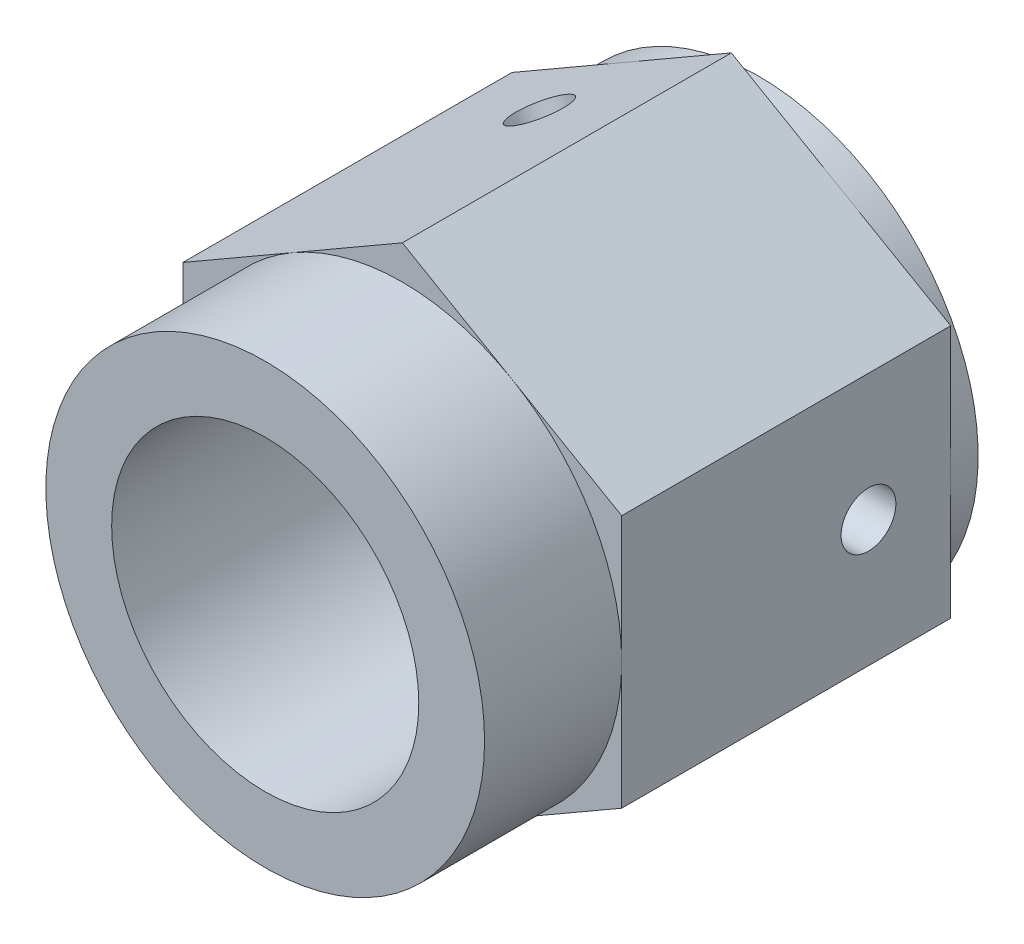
ISO-10303-21;
HEADER;
FILE_DESCRIPTION(('STEP AP214'),'2;1');
FILE_NAME('part.step','',(''),(''),'','','');
FILE_SCHEMA(('AUTOMOTIVE_DESIGN { 1 0 10303 214 1 1 1 1 }'));
ENDSEC;
DATA;
#1=APPLICATION_CONTEXT('core data for automotive mechanical design processes');
#2=APPLICATION_PROTOCOL_DEFINITION('international standard','automotive_design',2000,#1);
#3=PRODUCT_CONTEXT('',#1,'mechanical');
#4=PRODUCT('Part','Part','',(#3));
#5=PRODUCT_RELATED_PRODUCT_CATEGORY('part','',(#4));
#6=PRODUCT_DEFINITION_FORMATION('','',#4);
#7=PRODUCT_DEFINITION_CONTEXT('part definition',#1,'design');
#8=PRODUCT_DEFINITION('design','',#6,#7);
#9=PRODUCT_DEFINITION_SHAPE('','',#8);
#10=(LENGTH_UNIT() NAMED_UNIT(*) SI_UNIT(.MILLI.,.METRE.));
#11=(NAMED_UNIT(*) PLANE_ANGLE_UNIT() SI_UNIT($,.RADIAN.));
#12=(NAMED_UNIT(*) SI_UNIT($,.STERADIAN.) SOLID_ANGLE_UNIT());
#13=UNCERTAINTY_MEASURE_WITH_UNIT(LENGTH_MEASURE(1.E-05),#10,'distance_accuracy_value','');
#14=(GEOMETRIC_REPRESENTATION_CONTEXT(3) GLOBAL_UNCERTAINTY_ASSIGNED_CONTEXT((#13)) GLOBAL_UNIT_ASSIGNED_CONTEXT((#10,
#11,#12)) REPRESENTATION_CONTEXT('',''));
#15=CARTESIAN_POINT('',(0.,0.,0.));
#16=DIRECTION('',(0.,0.,1.));
#17=DIRECTION('',(1.,0.,0.));
#18=AXIS2_PLACEMENT_3D('',#15,#16,#17);
#19=CARTESIAN_POINT('',(0.,0.,0.));
#20=DIRECTION('',(0.,0.,1.));
#21=DIRECTION('',(1.,0.,0.));
#22=AXIS2_PLACEMENT_3D('',#19,#20,#21);
#23=PLANE('',#22);
#24=CARTESIAN_POINT('',(0.,0.,0.));
#25=DIRECTION('',(0.,0.,-1.));
#26=DIRECTION('',(-1.,0.,0.));
#27=AXIS2_PLACEMENT_3D('',#24,#25,#26);
#28=CIRCLE('',#27,40.);
#29=CARTESIAN_POINT('',(-40.,0.,0.));
#30=VERTEX_POINT('',#29);
#31=CARTESIAN_POINT('',(-20.,34.6410161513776,0.));
#32=VERTEX_POINT('',#31);
#33=EDGE_CURVE('E52',#30,#32,#28,.T.);
#34=ORIENTED_EDGE('',*,*,#33,.F.);
#35=DIRECTION('',(0.,-1.,0.));
#36=VECTOR('',#35,1.);
#37=CARTESIAN_POINT('',(-40.,23.094010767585,0.));
#38=LINE('',#37,#36);
#39=CARTESIAN_POINT('',(-40.,23.094010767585,0.));
#40=VERTEX_POINT('',#39);
#41=EDGE_CURVE('E135',#40,#30,#38,.T.);
#42=ORIENTED_EDGE('',*,*,#41,.F.);
#43=DIRECTION('',(-0.866025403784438,-0.5,0.));
#44=VECTOR('',#43,1.);
#45=CARTESIAN_POINT('',(0.,46.1880215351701,0.));
#46=LINE('',#45,#44);
#47=EDGE_CURVE('E152',#32,#40,#46,.T.);
#48=ORIENTED_EDGE('',*,*,#47,.F.);
#49=EDGE_LOOP('',(#34,#42,#48));
#50=FACE_BOUND('',#49,.T.);
#51=ADVANCED_FACE('F37',(#50),#23,.F.);
#52=CARTESIAN_POINT('',(20.,34.6410161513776,0.));
#53=VERTEX_POINT('',#52);
#54=EDGE_CURVE('E11',#32,#53,#28,.T.);
#55=ORIENTED_EDGE('',*,*,#54,.F.);
#56=CARTESIAN_POINT('',(0.,46.1880215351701,0.));
#57=VERTEX_POINT('',#56);
#58=EDGE_CURVE('E150',#57,#32,#46,.T.);
#59=ORIENTED_EDGE('',*,*,#58,.F.);
#60=DIRECTION('',(-0.866025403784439,0.5,0.));
#61=VECTOR('',#60,1.);
#62=CARTESIAN_POINT('',(40.,23.0940107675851,0.));
#63=LINE('',#62,#61);
#64=EDGE_CURVE('E172',#53,#57,#63,.T.);
#65=ORIENTED_EDGE('',*,*,#64,.F.);
#66=EDGE_LOOP('',(#55,#59,#65));
#67=FACE_BOUND('',#66,.T.);
#68=ADVANCED_FACE('F260',(#67),#23,.F.);
#69=CARTESIAN_POINT('',(40.,0.,0.));
#70=VERTEX_POINT('',#69);
#71=EDGE_CURVE('E50',#53,#70,#28,.T.);
#72=ORIENTED_EDGE('',*,*,#71,.F.);
#73=CARTESIAN_POINT('',(40.,23.0940107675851,0.));
#74=VERTEX_POINT('',#73);
#75=EDGE_CURVE('E200',#74,#53,#63,.T.);
#76=ORIENTED_EDGE('',*,*,#75,.F.);
#77=DIRECTION('',(0.,1.,0.));
#78=VECTOR('',#77,1.);
#79=CARTESIAN_POINT('',(40.,-23.094010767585,0.));
#80=LINE('',#79,#78);
#81=EDGE_CURVE('E209',#70,#74,#80,.T.);
#82=ORIENTED_EDGE('',*,*,#81,.F.);
#83=EDGE_LOOP('',(#72,#76,#82));
#84=FACE_BOUND('',#83,.T.);
#85=ADVANCED_FACE('F266',(#84),#23,.F.);
#86=CARTESIAN_POINT('',(20.,-34.6410161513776,0.));
#87=VERTEX_POINT('',#86);
#88=EDGE_CURVE('E162',#70,#87,#28,.T.);
#89=ORIENTED_EDGE('',*,*,#88,.F.);
#90=CARTESIAN_POINT('',(40.,-23.094010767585,0.));
#91=VERTEX_POINT('',#90);
#92=EDGE_CURVE('E210',#91,#70,#80,.T.);
#93=ORIENTED_EDGE('',*,*,#92,.F.);
#94=DIRECTION('',(0.866025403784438,0.5,0.));
#95=VECTOR('',#94,1.);
#96=CARTESIAN_POINT('',(0.,-46.1880215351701,0.));
#97=LINE('',#96,#95);
#98=EDGE_CURVE('E205',#87,#91,#97,.T.);
#99=ORIENTED_EDGE('',*,*,#98,.F.);
#100=EDGE_LOOP('',(#89,#93,#99));
#101=FACE_BOUND('',#100,.T.);
#102=ADVANCED_FACE('F287',(#101),#23,.F.);
#103=CARTESIAN_POINT('',(-20.,-34.6410161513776,0.));
#104=VERTEX_POINT('',#103);
#105=EDGE_CURVE('E160',#87,#104,#28,.T.);
#106=ORIENTED_EDGE('',*,*,#105,.F.);
#107=CARTESIAN_POINT('',(0.,-46.1880215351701,0.));
#108=VERTEX_POINT('',#107);
#109=EDGE_CURVE('E206',#108,#87,#97,.T.);
#110=ORIENTED_EDGE('',*,*,#109,.F.);
#111=DIRECTION('',(0.866025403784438,-0.5,0.));
#112=VECTOR('',#111,1.);
#113=CARTESIAN_POINT('',(-40.,-23.094010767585,0.));
#114=LINE('',#113,#112);
#115=EDGE_CURVE('E145',#104,#108,#114,.T.);
#116=ORIENTED_EDGE('',*,*,#115,.F.);
#117=EDGE_LOOP('',(#106,#110,#116));
#118=FACE_BOUND('',#117,.T.);
#119=ADVANCED_FACE('F272',(#118),#23,.F.);
#120=CARTESIAN_POINT('',(0.,0.,60.));
#121=DIRECTION('',(0.,0.,1.));
#122=DIRECTION('',(1.,0.,0.));
#123=AXIS2_PLACEMENT_3D('',#120,#121,#122);
#124=PLANE('',#123);
#125=CARTESIAN_POINT('',(0.,0.,60.));
#126=DIRECTION('',(0.,0.,1.));
#127=DIRECTION('',(1.,0.,0.));
#128=AXIS2_PLACEMENT_3D('',#125,#126,#127);
#129=CIRCLE('',#128,40.);
#130=CARTESIAN_POINT('',(40.,0.,60.));
#131=VERTEX_POINT('',#130);
#132=CARTESIAN_POINT('',(20.,34.6410161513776,60.));
#133=VERTEX_POINT('',#132);
#134=EDGE_CURVE('E166',#131,#133,#129,.T.);
#135=ORIENTED_EDGE('',*,*,#134,.F.);
#136=DIRECTION('',(0.,1.,0.));
#137=VECTOR('',#136,1.);
#138=CARTESIAN_POINT('',(40.,-23.094010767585,60.));
#139=LINE('',#138,#137);
#140=CARTESIAN_POINT('',(40.,23.0940107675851,60.));
#141=VERTEX_POINT('',#140);
#142=EDGE_CURVE('E196',#131,#141,#139,.T.);
#143=ORIENTED_EDGE('',*,*,#142,.T.);
#144=DIRECTION('',(-0.866025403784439,0.5,0.));
#145=VECTOR('',#144,1.);
#146=CARTESIAN_POINT('',(40.,23.0940107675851,60.));
#147=LINE('',#146,#145);
#148=EDGE_CURVE('E176',#141,#133,#147,.T.);
#149=ORIENTED_EDGE('',*,*,#148,.T.);
#150=EDGE_LOOP('',(#135,#143,#149));
#151=FACE_BOUND('',#150,.T.);
#152=ADVANCED_FACE('F284',(#151),#124,.T.);
#153=CARTESIAN_POINT('',(-20.,34.6410161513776,60.));
#154=VERTEX_POINT('',#153);
#155=EDGE_CURVE('E161',#133,#154,#129,.T.);
#156=ORIENTED_EDGE('',*,*,#155,.F.);
#157=CARTESIAN_POINT('',(0.,46.1880215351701,60.));
#158=VERTEX_POINT('',#157);
#159=EDGE_CURVE('E180',#133,#158,#147,.T.);
#160=ORIENTED_EDGE('',*,*,#159,.T.);
#161=DIRECTION('',(-0.866025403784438,-0.5,0.));
#162=VECTOR('',#161,1.);
#163=CARTESIAN_POINT('',(0.,46.1880215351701,60.));
#164=LINE('',#163,#162);
#165=EDGE_CURVE('E181',#158,#154,#164,.T.);
#166=ORIENTED_EDGE('',*,*,#165,.T.);
#167=EDGE_LOOP('',(#156,#160,#166));
#168=FACE_BOUND('',#167,.T.);
#169=ADVANCED_FACE('F294',(#168),#124,.T.);
#170=CARTESIAN_POINT('',(-40.,0.,60.));
#171=VERTEX_POINT('',#170);
#172=EDGE_CURVE('E164',#154,#171,#129,.T.);
#173=ORIENTED_EDGE('',*,*,#172,.F.);
#174=CARTESIAN_POINT('',(-40.,23.094010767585,60.));
#175=VERTEX_POINT('',#174);
#176=EDGE_CURVE('E179',#154,#175,#164,.T.);
#177=ORIENTED_EDGE('',*,*,#176,.T.);
#178=DIRECTION('',(0.,-1.,0.));
#179=VECTOR('',#178,1.);
#180=CARTESIAN_POINT('',(-40.,23.094010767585,60.));
#181=LINE('',#180,#179);
#182=EDGE_CURVE('E185',#175,#171,#181,.T.);
#183=ORIENTED_EDGE('',*,*,#182,.T.);
#184=EDGE_LOOP('',(#173,#177,#183));
#185=FACE_BOUND('',#184,.T.);
#186=ADVANCED_FACE('F330',(#185),#124,.T.);
#187=CARTESIAN_POINT('',(-20.,-34.6410161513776,60.));
#188=VERTEX_POINT('',#187);
#189=EDGE_CURVE('E327',#171,#188,#129,.T.);
#190=ORIENTED_EDGE('',*,*,#189,.F.);
#191=CARTESIAN_POINT('',(-40.,-23.094010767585,60.));
#192=VERTEX_POINT('',#191);
#193=EDGE_CURVE('E184',#171,#192,#181,.T.);
#194=ORIENTED_EDGE('',*,*,#193,.T.);
#195=DIRECTION('',(0.866025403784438,-0.5,0.));
#196=VECTOR('',#195,1.);
#197=CARTESIAN_POINT('',(-40.,-23.094010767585,60.));
#198=LINE('',#197,#196);
#199=EDGE_CURVE('E189',#192,#188,#198,.T.);
#200=ORIENTED_EDGE('',*,*,#199,.T.);
#201=EDGE_LOOP('',(#190,#194,#200));
#202=FACE_BOUND('',#201,.T.);
#203=ADVANCED_FACE('F339',(#202),#124,.T.);
#204=CARTESIAN_POINT('',(20.,-34.6410161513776,60.));
#205=VERTEX_POINT('',#204);
#206=EDGE_CURVE('E321',#188,#205,#129,.T.);
#207=ORIENTED_EDGE('',*,*,#206,.F.);
#208=CARTESIAN_POINT('',(0.,-46.1880215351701,60.));
#209=VERTEX_POINT('',#208);
#210=EDGE_CURVE('E188',#188,#209,#198,.T.);
#211=ORIENTED_EDGE('',*,*,#210,.T.);
#212=DIRECTION('',(0.866025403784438,0.5,0.));
#213=VECTOR('',#212,1.);
#214=CARTESIAN_POINT('',(0.,-46.1880215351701,60.));
#215=LINE('',#214,#213);
#216=EDGE_CURVE('E193',#209,#205,#215,.T.);
#217=ORIENTED_EDGE('',*,*,#216,.T.);
#218=EDGE_LOOP('',(#207,#211,#217));
#219=FACE_BOUND('',#218,.T.);
#220=ADVANCED_FACE('F285',(#219),#124,.T.);
#221=CARTESIAN_POINT('',(40.,23.0940107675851,60.));
#222=DIRECTION('',(-0.5,-0.866025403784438,0.));
#223=DIRECTION('',(0.866025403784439,-0.5,0.));
#224=AXIS2_PLACEMENT_3D('',#221,#222,#223);
#225=PLANE('',#224);
#226=ORIENTED_EDGE('',*,*,#75,.T.);
#227=ORIENTED_EDGE('',*,*,#64,.T.);
#228=DIRECTION('',(0.,0.,-1.));
#229=VECTOR('',#228,1.);
#230=CARTESIAN_POINT('',(0.,46.1880215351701,60.));
#231=LINE('',#230,#229);
#232=EDGE_CURVE('E224',#158,#57,#231,.T.);
#233=ORIENTED_EDGE('',*,*,#232,.F.);
#234=ORIENTED_EDGE('',*,*,#159,.F.);
#235=ORIENTED_EDGE('',*,*,#148,.F.);
#236=DIRECTION('',(0.,0.,-1.));
#237=VECTOR('',#236,1.);
#238=CARTESIAN_POINT('',(40.,23.0940107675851,60.));
#239=LINE('',#238,#237);
#240=EDGE_CURVE('E199',#141,#74,#239,.T.);
#241=ORIENTED_EDGE('',*,*,#240,.T.);
#242=EDGE_LOOP('',(#226,#227,#233,#234,#235,#241));
#243=FACE_BOUND('',#242,.T.);
#244=ADVANCED_FACE('F39',(#243),#225,.F.);
#245=CARTESIAN_POINT('',(0.,46.1880215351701,60.));
#246=DIRECTION('',(0.5,-0.866025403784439,0.));
#247=DIRECTION('',(0.866025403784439,0.5,0.));
#248=AXIS2_PLACEMENT_3D('',#245,#246,#247);
#249=PLANE('',#248);
#250=CARTESIAN_POINT('',(-20.,34.6410161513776,15.));
#251=DIRECTION('',(-0.5,0.866025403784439,0.));
#252=DIRECTION('',(-0.866025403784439,-0.5,0.));
#253=AXIS2_PLACEMENT_3D('',#250,#251,#252);
#254=CIRCLE('',#253,5.);
#255=CARTESIAN_POINT('',(-24.3301270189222,32.1410161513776,15.));
#256=VERTEX_POINT('',#255);
#257=EDGE_CURVE('E233',#256,#256,#254,.T.);
#258=ORIENTED_EDGE('',*,*,#257,.F.);
#259=EDGE_LOOP('',(#258));
#260=FACE_BOUND('',#259,.T.);
#261=ORIENTED_EDGE('',*,*,#58,.T.);
#262=ORIENTED_EDGE('',*,*,#47,.T.);
#263=DIRECTION('',(0.,0.,-1.));
#264=VECTOR('',#263,1.);
#265=CARTESIAN_POINT('',(-40.,23.094010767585,60.));
#266=LINE('',#265,#264);
#267=EDGE_CURVE('E142',#175,#40,#266,.T.);
#268=ORIENTED_EDGE('',*,*,#267,.F.);
#269=ORIENTED_EDGE('',*,*,#176,.F.);
#270=ORIENTED_EDGE('',*,*,#165,.F.);
#271=ORIENTED_EDGE('',*,*,#232,.T.);
#272=EDGE_LOOP('',(#261,#262,#268,#269,#270,#271));
#273=FACE_BOUND('',#272,.T.);
#274=ADVANCED_FACE('F333',(#260,#273),#249,.F.);
#275=CARTESIAN_POINT('',(-40.,23.094010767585,60.));
#276=DIRECTION('',(1.,0.,0.));
#277=DIRECTION('',(0.,0.,-1.));
#278=AXIS2_PLACEMENT_3D('',#275,#276,#277);
#279=PLANE('',#278);
#280=ORIENTED_EDGE('',*,*,#41,.T.);
#281=CARTESIAN_POINT('',(-40.,-23.094010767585,0.));
#282=VERTEX_POINT('',#281);
#283=EDGE_CURVE('E138',#30,#282,#38,.T.);
#284=ORIENTED_EDGE('',*,*,#283,.T.);
#285=DIRECTION('',(0.,0.,-1.));
#286=VECTOR('',#285,1.);
#287=CARTESIAN_POINT('',(-40.,-23.094010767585,60.));
#288=LINE('',#287,#286);
#289=EDGE_CURVE('E221',#192,#282,#288,.T.);
#290=ORIENTED_EDGE('',*,*,#289,.F.);
#291=ORIENTED_EDGE('',*,*,#193,.F.);
#292=ORIENTED_EDGE('',*,*,#182,.F.);
#293=ORIENTED_EDGE('',*,*,#267,.T.);
#294=EDGE_LOOP('',(#280,#284,#290,#291,#292,#293));
#295=FACE_BOUND('',#294,.T.);
#296=ADVANCED_FACE('F136',(#295),#279,.F.);
#297=CARTESIAN_POINT('',(-40.,-23.094010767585,60.));
#298=DIRECTION('',(0.5,0.866025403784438,0.));
#299=DIRECTION('',(-0.866025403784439,0.5,0.));
#300=AXIS2_PLACEMENT_3D('',#297,#298,#299);
#301=PLANE('',#300);
#302=CARTESIAN_POINT('',(-20.,-34.6410161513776,15.));
#303=DIRECTION('',(-0.5,-0.866025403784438,0.));
#304=DIRECTION('',(0.866025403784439,-0.5,0.));
#305=AXIS2_PLACEMENT_3D('',#302,#303,#304);
#306=CIRCLE('',#305,5.);
#307=CARTESIAN_POINT('',(-15.6698729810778,-37.1410161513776,15.));
#308=VERTEX_POINT('',#307);
#309=EDGE_CURVE('E370',#308,#308,#306,.T.);
#310=ORIENTED_EDGE('',*,*,#309,.F.);
#311=EDGE_LOOP('',(#310));
#312=FACE_BOUND('',#311,.T.);
#313=EDGE_CURVE('E149',#282,#104,#114,.T.);
#314=ORIENTED_EDGE('',*,*,#313,.T.);
#315=ORIENTED_EDGE('',*,*,#115,.T.);
#316=DIRECTION('',(0.,0.,-1.));
#317=VECTOR('',#316,1.);
#318=CARTESIAN_POINT('',(0.,-46.1880215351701,60.));
#319=LINE('',#318,#317);
#320=EDGE_CURVE('E218',#209,#108,#319,.T.);
#321=ORIENTED_EDGE('',*,*,#320,.F.);
#322=ORIENTED_EDGE('',*,*,#210,.F.);
#323=ORIENTED_EDGE('',*,*,#199,.F.);
#324=ORIENTED_EDGE('',*,*,#289,.T.);
#325=EDGE_LOOP('',(#314,#315,#321,#322,#323,#324));
#326=FACE_BOUND('',#325,.T.);
#327=ADVANCED_FACE('F401',(#312,#326),#301,.F.);
#328=CARTESIAN_POINT('',(0.,-46.1880215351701,60.));
#329=DIRECTION('',(-0.5,0.866025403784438,0.));
#330=DIRECTION('',(-0.866025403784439,-0.5,0.));
#331=AXIS2_PLACEMENT_3D('',#328,#329,#330);
#332=PLANE('',#331);
#333=ORIENTED_EDGE('',*,*,#109,.T.);
#334=ORIENTED_EDGE('',*,*,#98,.T.);
#335=DIRECTION('',(0.,0.,-1.));
#336=VECTOR('',#335,1.);
#337=CARTESIAN_POINT('',(40.,-23.094010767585,60.));
#338=LINE('',#337,#336);
#339=CARTESIAN_POINT('',(40.,-23.094010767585,60.));
#340=VERTEX_POINT('',#339);
#341=EDGE_CURVE('E215',#340,#91,#338,.T.);
#342=ORIENTED_EDGE('',*,*,#341,.F.);
#343=EDGE_CURVE('E192',#205,#340,#215,.T.);
#344=ORIENTED_EDGE('',*,*,#343,.F.);
#345=ORIENTED_EDGE('',*,*,#216,.F.);
#346=ORIENTED_EDGE('',*,*,#320,.T.);
#347=EDGE_LOOP('',(#333,#334,#342,#344,#345,#346));
#348=FACE_BOUND('',#347,.T.);
#349=ADVANCED_FACE('F303',(#348),#332,.F.);
#350=CARTESIAN_POINT('',(40.,-23.094010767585,60.));
#351=DIRECTION('',(-1.,0.,0.));
#352=DIRECTION('',(0.,0.,1.));
#353=AXIS2_PLACEMENT_3D('',#350,#351,#352);
#354=PLANE('',#353);
#355=CARTESIAN_POINT('',(40.,0.,15.));
#356=DIRECTION('',(1.,0.,0.));
#357=DIRECTION('',(0.,0.,-1.));
#358=AXIS2_PLACEMENT_3D('',#355,#356,#357);
#359=CIRCLE('',#358,5.);
#360=CARTESIAN_POINT('',(40.,0.,10.));
#361=VERTEX_POINT('',#360);
#362=EDGE_CURVE('E373',#361,#361,#359,.T.);
#363=ORIENTED_EDGE('',*,*,#362,.F.);
#364=EDGE_LOOP('',(#363));
#365=FACE_BOUND('',#364,.T.);
#366=ORIENTED_EDGE('',*,*,#92,.T.);
#367=ORIENTED_EDGE('',*,*,#81,.T.);
#368=ORIENTED_EDGE('',*,*,#240,.F.);
#369=ORIENTED_EDGE('',*,*,#142,.F.);
#370=EDGE_CURVE('E197',#340,#131,#139,.T.);
#371=ORIENTED_EDGE('',*,*,#370,.F.);
#372=ORIENTED_EDGE('',*,*,#341,.T.);
#373=EDGE_LOOP('',(#366,#367,#368,#369,#371,#372));
#374=FACE_BOUND('',#373,.T.);
#375=ADVANCED_FACE('F282',(#365,#374),#354,.F.);
#376=EDGE_CURVE('E175',#205,#131,#129,.T.);
#377=ORIENTED_EDGE('',*,*,#376,.F.);
#378=ORIENTED_EDGE('',*,*,#343,.T.);
#379=ORIENTED_EDGE('',*,*,#370,.T.);
#380=EDGE_LOOP('',(#377,#378,#379));
#381=FACE_BOUND('',#380,.T.);
#382=ADVANCED_FACE('F271',(#381),#124,.T.);
#383=EDGE_CURVE('E65',#104,#30,#28,.T.);
#384=ORIENTED_EDGE('',*,*,#383,.F.);
#385=ORIENTED_EDGE('',*,*,#313,.F.);
#386=ORIENTED_EDGE('',*,*,#283,.F.);
#387=EDGE_LOOP('',(#384,#385,#386));
#388=FACE_BOUND('',#387,.T.);
#389=ADVANCED_FACE('F147',(#388),#23,.F.);
#390=CARTESIAN_POINT('',(0.,0.,85.));
#391=DIRECTION('',(0.,0.,-1.));
#392=DIRECTION('',(-1.,0.,0.));
#393=AXIS2_PLACEMENT_3D('',#390,#391,#392);
#394=CYLINDRICAL_SURFACE('',#393,40.);
#395=CARTESIAN_POINT('',(0.,0.,85.));
#396=DIRECTION('',(0.,0.,1.));
#397=DIRECTION('',(1.,0.,0.));
#398=AXIS2_PLACEMENT_3D('',#395,#396,#397);
#399=CIRCLE('',#398,40.);
#400=CARTESIAN_POINT('',(40.,0.,85.));
#401=VERTEX_POINT('',#400);
#402=EDGE_CURVE('E170',#401,#401,#399,.T.);
#403=ORIENTED_EDGE('',*,*,#402,.F.);
#404=EDGE_LOOP('',(#403));
#405=FACE_BOUND('',#404,.T.);
#406=ORIENTED_EDGE('',*,*,#134,.T.);
#407=ORIENTED_EDGE('',*,*,#155,.T.);
#408=ORIENTED_EDGE('',*,*,#172,.T.);
#409=ORIENTED_EDGE('',*,*,#189,.T.);
#410=ORIENTED_EDGE('',*,*,#206,.T.);
#411=ORIENTED_EDGE('',*,*,#376,.T.);
#412=EDGE_LOOP('',(#406,#407,#408,#409,#410,#411));
#413=FACE_BOUND('',#412,.T.);
#414=ADVANCED_FACE('F270',(#405,#413),#394,.T.);
#415=CARTESIAN_POINT('',(0.,0.,85.));
#416=DIRECTION('',(0.,0.,1.));
#417=DIRECTION('',(1.,0.,0.));
#418=AXIS2_PLACEMENT_3D('',#415,#416,#417);
#419=PLANE('',#418);
#420=CARTESIAN_POINT('',(0.,0.,85.));
#421=DIRECTION('',(0.,0.,1.));
#422=DIRECTION('',(1.,0.,0.));
#423=AXIS2_PLACEMENT_3D('',#420,#421,#422);
#424=CIRCLE('',#423,28.);
#425=CARTESIAN_POINT('',(28.,0.,85.));
#426=VERTEX_POINT('',#425);
#427=EDGE_CURVE('E232',#426,#426,#424,.T.);
#428=ORIENTED_EDGE('',*,*,#427,.F.);
#429=EDGE_LOOP('',(#428));
#430=FACE_BOUND('',#429,.T.);
#431=ORIENTED_EDGE('',*,*,#402,.T.);
#432=EDGE_LOOP('',(#431));
#433=FACE_BOUND('',#432,.T.);
#434=ADVANCED_FACE('F278',(#430,#433),#419,.T.);
#435=CARTESIAN_POINT('',(0.,0.,-5.));
#436=DIRECTION('',(0.,0.,1.));
#437=DIRECTION('',(1.,0.,0.));
#438=AXIS2_PLACEMENT_3D('',#435,#436,#437);
#439=CYLINDRICAL_SURFACE('',#438,40.);
#440=CARTESIAN_POINT('',(0.,0.,-5.));
#441=DIRECTION('',(0.,0.,-1.));
#442=DIRECTION('',(-1.,0.,0.));
#443=AXIS2_PLACEMENT_3D('',#440,#441,#442);
#444=CIRCLE('',#443,40.);
#445=CARTESIAN_POINT('',(-40.,0.,-5.));
#446=VERTEX_POINT('',#445);
#447=EDGE_CURVE('E155',#446,#446,#444,.T.);
#448=ORIENTED_EDGE('',*,*,#447,.F.);
#449=EDGE_LOOP('',(#448));
#450=FACE_BOUND('',#449,.T.);
#451=ORIENTED_EDGE('',*,*,#33,.T.);
#452=ORIENTED_EDGE('',*,*,#54,.T.);
#453=ORIENTED_EDGE('',*,*,#71,.T.);
#454=ORIENTED_EDGE('',*,*,#88,.T.);
#455=ORIENTED_EDGE('',*,*,#105,.T.);
#456=ORIENTED_EDGE('',*,*,#383,.T.);
#457=EDGE_LOOP('',(#451,#452,#453,#454,#455,#456));
#458=FACE_BOUND('',#457,.T.);
#459=ADVANCED_FACE('F158',(#450,#458),#439,.T.);
#460=CARTESIAN_POINT('',(0.,0.,-5.));
#461=DIRECTION('',(0.,0.,-1.));
#462=DIRECTION('',(-1.,0.,0.));
#463=AXIS2_PLACEMENT_3D('',#460,#461,#462);
#464=PLANE('',#463);
#465=CARTESIAN_POINT('',(0.,0.,-5.));
#466=DIRECTION('',(0.,0.,-1.));
#467=DIRECTION('',(-1.,0.,0.));
#468=AXIS2_PLACEMENT_3D('',#465,#466,#467);
#469=CIRCLE('',#468,15.);
#470=CARTESIAN_POINT('',(-15.,0.,-5.));
#471=VERTEX_POINT('',#470);
#472=EDGE_CURVE('E156',#471,#471,#469,.T.);
#473=ORIENTED_EDGE('',*,*,#472,.F.);
#474=EDGE_LOOP('',(#473));
#475=FACE_BOUND('',#474,.T.);
#476=ORIENTED_EDGE('',*,*,#447,.T.);
#477=EDGE_LOOP('',(#476));
#478=FACE_BOUND('',#477,.T.);
#479=ADVANCED_FACE('F345',(#475,#478),#464,.T.);
#480=CARTESIAN_POINT('',(0.,0.,40.));
#481=DIRECTION('',(0.,0.,-1.));
#482=DIRECTION('',(-1.,0.,0.));
#483=AXIS2_PLACEMENT_3D('',#480,#481,#482);
#484=CYLINDRICAL_SURFACE('',#483,15.);
#485=CARTESIAN_POINT('',(15.,0.,10.));
#486=CARTESIAN_POINT('',(15.0000007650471,0.272816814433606,9.99999873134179));
#487=CARTESIAN_POINT('',(14.9924884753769,0.545625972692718,10.022401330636));
#488=CARTESIAN_POINT('',(14.9632605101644,1.08320880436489,10.1111455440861));
#489=CARTESIAN_POINT('',(14.941543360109,1.3479816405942,10.1774917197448));
#490=CARTESIAN_POINT('',(14.8862653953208,1.86166394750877,10.3515962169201));
#491=CARTESIAN_POINT('',(14.8527243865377,2.11059912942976,10.4592853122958));
#492=CARTESIAN_POINT('',(14.7772222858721,2.58687468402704,10.7127058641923));
#493=CARTESIAN_POINT('',(14.7352595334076,2.81421078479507,10.8584448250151));
#494=CARTESIAN_POINT('',(14.6457047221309,3.24870837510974,11.1891290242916));
#495=CARTESIAN_POINT('',(14.5979778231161,3.45501850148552,11.3751561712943));
#496=CARTESIAN_POINT('',(14.5030157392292,3.83416346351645,11.778835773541));
#497=CARTESIAN_POINT('',(14.4557806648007,4.00699092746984,11.9964951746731));
#498=CARTESIAN_POINT('',(14.3656666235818,4.31912471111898,12.4649255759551));
#499=CARTESIAN_POINT('',(14.3229519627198,4.45732429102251,12.7164686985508));
#500=CARTESIAN_POINT('',(14.2487652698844,4.68909436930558,13.2408804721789));
#501=CARTESIAN_POINT('',(14.2172898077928,4.78267848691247,13.5137425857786));
#502=CARTESIAN_POINT('',(14.1705651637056,4.91936730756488,14.0633661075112));
#503=CARTESIAN_POINT('',(14.1548047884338,4.96406724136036,14.3396860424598));
#504=CARTESIAN_POINT('',(14.1397828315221,5.00670561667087,14.896318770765));
#505=CARTESIAN_POINT('',(14.1405161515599,5.00465850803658,15.1766303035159));
#506=CARTESIAN_POINT('',(14.1579507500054,4.95509951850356,15.7196831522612));
#507=CARTESIAN_POINT('',(14.1739207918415,4.90966956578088,15.9826420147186));
#508=CARTESIAN_POINT('',(14.2188328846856,4.77803081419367,16.4969670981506));
#509=CARTESIAN_POINT('',(14.2477764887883,4.69181713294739,16.7483319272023));
#510=CARTESIAN_POINT('',(14.3158955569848,4.47969529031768,17.2370637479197));
#511=CARTESIAN_POINT('',(14.3552282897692,4.35317024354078,17.4741401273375));
#512=CARTESIAN_POINT('',(14.4396279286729,4.06444553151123,17.9243545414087));
#513=CARTESIAN_POINT('',(14.4846964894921,3.9022355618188,18.1374856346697));
#514=CARTESIAN_POINT('',(14.5783664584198,3.53674666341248,18.5454579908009));
#515=CARTESIAN_POINT('',(14.6270294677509,3.3317657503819,18.7387634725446));
#516=CARTESIAN_POINT('',(14.7203469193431,2.89169784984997,19.0886563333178));
#517=CARTESIAN_POINT('',(14.765000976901,2.65660797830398,19.2452401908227));
#518=CARTESIAN_POINT('',(14.8458553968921,2.15973806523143,19.5184815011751));
#519=CARTESIAN_POINT('',(14.8819675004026,1.89771638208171,19.6347274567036));
#520=CARTESIAN_POINT('',(14.9410283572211,1.35634541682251,19.8210158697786));
#521=CARTESIAN_POINT('',(14.9639816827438,1.07700219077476,19.8910743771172));
#522=CARTESIAN_POINT('',(14.9933813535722,0.521919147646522,19.9802783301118));
#523=CARTESIAN_POINT('',(15.0005000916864,0.246547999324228,20.0014990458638));
#524=CARTESIAN_POINT('',(14.9994451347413,-0.303875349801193,19.9983366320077));
#525=CARTESIAN_POINT('',(14.9912740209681,-0.578927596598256,19.9739612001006));
#526=CARTESIAN_POINT('',(14.9610012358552,-1.11259933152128,19.8819404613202));
#527=CARTESIAN_POINT('',(14.9393099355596,-1.37146403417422,19.8155689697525));
#528=CARTESIAN_POINT('',(14.8845923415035,-1.87427979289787,19.6430327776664));
#529=CARTESIAN_POINT('',(14.8515646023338,-2.11822894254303,19.5368630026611));
#530=CARTESIAN_POINT('',(14.7764465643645,-2.59144148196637,19.2846478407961));
#531=CARTESIAN_POINT('',(14.7341407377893,-2.82014979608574,19.1376270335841));
#532=CARTESIAN_POINT('',(14.6452626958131,-3.25032415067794,18.8090292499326));
#533=CARTESIAN_POINT('',(14.5986891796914,-3.45178183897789,18.6274417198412));
#534=CARTESIAN_POINT('',(14.5038423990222,-3.8312625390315,18.2251062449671));
#535=CARTESIAN_POINT('',(14.4555880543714,-4.00780484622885,18.0029538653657));
#536=CARTESIAN_POINT('',(14.3649986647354,-4.32128761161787,17.5311421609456));
#537=CARTESIAN_POINT('',(14.3226636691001,-4.45822773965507,17.2814826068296));
#538=CARTESIAN_POINT('',(14.2491195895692,-4.68798465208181,16.7616349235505));
#539=CARTESIAN_POINT('',(14.2178880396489,-4.78089066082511,16.4914896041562));
#540=CARTESIAN_POINT('',(14.1705416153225,-4.91947333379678,15.9381067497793));
#541=CARTESIAN_POINT('',(14.154419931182,-4.9651712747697,15.6548751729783));
#542=CARTESIAN_POINT('',(14.1398929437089,-5.00638141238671,15.0990145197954));
#543=CARTESIAN_POINT('',(14.1406200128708,-5.004351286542,14.8265882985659));
#544=CARTESIAN_POINT('',(14.1575634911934,-4.95621146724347,14.2861746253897));
#545=CARTESIAN_POINT('',(14.1737789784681,-4.91010439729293,14.0181869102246));
#546=CARTESIAN_POINT('',(14.2192262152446,-4.77685906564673,13.4993216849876));
#547=CARTESIAN_POINT('',(14.2482049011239,-4.69051673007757,13.2482158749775));
#548=CARTESIAN_POINT('',(14.3158199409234,-4.47989682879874,12.7638629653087));
#549=CARTESIAN_POINT('',(14.3544584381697,-4.35561084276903,12.53061984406));
#550=CARTESIAN_POINT('',(14.4391414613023,-4.06630346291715,12.0775816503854));
#551=CARTESIAN_POINT('',(14.4854355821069,-3.8997412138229,11.8588174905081));
#552=CARTESIAN_POINT('',(14.5791678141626,-3.53321441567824,11.451550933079));
#553=CARTESIAN_POINT('',(14.6266062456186,-3.33324042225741,11.2630571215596));
#554=CARTESIAN_POINT('',(14.7195015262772,-2.89620778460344,10.9142779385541));
#555=CARTESIAN_POINT('',(14.7648090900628,-2.65800756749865,10.755378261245));
#556=CARTESIAN_POINT('',(14.8462995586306,-2.15678678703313,10.4800478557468));
#557=CARTESIAN_POINT('',(14.8824847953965,-1.89377259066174,10.3636062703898));
#558=CARTESIAN_POINT('',(14.9402757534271,-1.36246823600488,10.1813918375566));
#559=CARTESIAN_POINT('',(14.9624606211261,-1.09493878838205,10.1135876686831));
#560=CARTESIAN_POINT('',(14.9923203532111,-0.551602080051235,10.0228985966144));
#561=CARTESIAN_POINT('',(14.9999992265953,-0.275797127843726,10.0000012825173));
#562=CARTESIAN_POINT('',(15.,0.,10.));
#563=B_SPLINE_CURVE_WITH_KNOTS('',3,(#485,#486,#487,#488,#489,#490,#491,#492,#493,#494,#495,
#496,#497,#498,#499,#500,#501,#502,#503,#504,#505,#506,#507,#508,#509,#510,#511,#512,#513,#514,
#515,#516,#517,#518,#519,#520,#521,#522,#523,#524,#525,#526,#527,#528,#529,#530,#531,#532,#533,
#534,#535,#536,#537,#538,#539,#540,#541,#542,#543,#544,#545,#546,#547,#548,#549,#550,#551,#552,
#553,#554,#555,#556,#557,#558,#559,#560,#561,#562),.UNSPECIFIED.,.T.,.F.,(4,2,2,2,2,2,2,2,2,2,2,
2,2,2,2,2,2,2,2,2,2,2,2,2,2,2,2,2,2,2,2,2,2,2,2,2,2,2,4),(0.,0.817435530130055,1.6349559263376,
2.45111336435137,3.2674318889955,4.1092342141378,4.95122166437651,5.81741924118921,
6.6833522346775,7.52009628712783,8.3565816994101,9.15484132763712,9.9531965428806,
10.764408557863,11.5758551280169,12.4296652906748,13.2835572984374,14.1459202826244,
15.0079834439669,15.832679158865,16.6572356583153,17.4579078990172,18.2586822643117,
19.0805199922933,19.9026090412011,20.7620511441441,21.6215004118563,22.479200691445,
23.3365142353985,24.1497833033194,24.9630039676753,25.7607793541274,26.5587319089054,
27.3915033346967,28.2245105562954,29.0899830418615,29.9552340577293,30.7818279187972,
31.6081933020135),.UNSPECIFIED.);
#564=CARTESIAN_POINT('',(15.,0.,10.));
#565=VERTEX_POINT('',#564);
#566=EDGE_CURVE('E41',#565,#565,#563,.T.);
#567=ORIENTED_EDGE('',*,*,#566,.T.);
#568=EDGE_LOOP('',(#567));
#569=FACE_BOUND('',#568,.T.);
#570=CARTESIAN_POINT('',(-2.74094079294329,-14.7474487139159,15.));
#571=CARTESIAN_POINT('',(-2.7409392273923,-14.7474485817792,15.2723408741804));
#572=CARTESIAN_POINT('',(-2.7642521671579,-14.7431730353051,15.544673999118));
#573=CARTESIAN_POINT('',(-2.85621974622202,-14.7256290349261,16.0812721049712));
#574=CARTESIAN_POINT('',(-2.92488185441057,-14.7123590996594,16.3455357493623));
#575=CARTESIAN_POINT('',(-3.10387971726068,-14.6756322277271,16.8581344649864));
#576=CARTESIAN_POINT('',(-3.21413379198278,-14.6521952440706,17.1064996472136));
#577=CARTESIAN_POINT('',(-3.47146220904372,-14.5933652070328,17.5818002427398));
#578=CARTESIAN_POINT('',(-3.61854467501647,-14.5579695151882,17.8087309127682));
#579=CARTESIAN_POINT('',(-3.94975384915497,-14.4716858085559,18.2435998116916));
#580=CARTESIAN_POINT('',(-4.13501077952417,-14.42029217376,18.4505771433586));
#581=CARTESIAN_POINT('',(-4.53246809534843,-14.3003416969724,18.8310340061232));
#582=CARTESIAN_POINT('',(-4.74467279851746,-14.231782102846,19.0045081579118));
#583=CARTESIAN_POINT('',(-5.19485467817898,-14.073797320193,19.317394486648));
#584=CARTESIAN_POINT('',(-5.43335983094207,-13.9838743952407,19.4557998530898));
#585=CARTESIAN_POINT('',(-5.92316770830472,-13.7835396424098,19.6879579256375));
#586=CARTESIAN_POINT('',(-6.1744669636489,-13.6731333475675,19.7817226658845));
#587=CARTESIAN_POINT('',(-6.67228822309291,-13.4370303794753,19.918679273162));
#588=CARTESIAN_POINT('',(-6.91867222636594,-13.3119993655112,19.963517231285));
#589=CARTESIAN_POINT('',(-7.40713565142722,-13.0465140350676,20.0065814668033));
#590=CARTESIAN_POINT('',(-7.64921616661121,-12.9060637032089,20.0048197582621));
#591=CARTESIAN_POINT('',(-8.11230738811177,-12.6198934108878,19.9557787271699));
#592=CARTESIAN_POINT('',(-8.33377208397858,-12.4745961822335,19.9102873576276));
#593=CARTESIAN_POINT('',(-8.76030230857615,-12.1788542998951,19.7780350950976));
#594=CARTESIAN_POINT('',(-8.96536672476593,-12.0284092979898,19.6912714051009));
#595=CARTESIAN_POINT('',(-9.35744889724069,-11.7260521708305,19.4778934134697));
#596=CARTESIAN_POINT('',(-9.54419402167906,-11.5741467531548,19.3507703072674));
#597=CARTESIAN_POINT('',(-9.8935865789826,-11.2769513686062,19.0607014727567));
#598=CARTESIAN_POINT('',(-10.0562272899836,-11.1316632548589,18.8977457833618));
#599=CARTESIAN_POINT('',(-10.3624817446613,-10.8473362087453,18.5316280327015));
#600=CARTESIAN_POINT('',(-10.5048391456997,-10.7089135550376,18.3269342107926));
#601=CARTESIAN_POINT('',(-10.7594278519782,-10.4531031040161,17.8877563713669));
#602=CARTESIAN_POINT('',(-10.8716545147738,-10.3357185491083,17.6532677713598));
#603=CARTESIAN_POINT('',(-11.0661436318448,-10.1272484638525,17.1567318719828));
#604=CARTESIAN_POINT('',(-11.1479560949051,-10.0365617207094,16.8943393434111));
#605=CARTESIAN_POINT('',(-11.2782028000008,-9.88998833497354,16.3521430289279));
#606=CARTESIAN_POINT('',(-11.326651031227,-9.83408710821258,16.0723465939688));
#607=CARTESIAN_POINT('',(-11.3879957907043,-9.7629744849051,15.5168082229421));
#608=CARTESIAN_POINT('',(-11.4023976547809,-9.74604111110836,15.2414528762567));
#609=CARTESIAN_POINT('',(-11.3998353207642,-9.74903958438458,14.6911192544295));
#610=CARTESIAN_POINT('',(-11.3828768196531,-9.76896473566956,14.4161409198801));
#611=CARTESIAN_POINT('',(-11.3190215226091,-9.84286385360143,13.8842151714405));
#612=CARTESIAN_POINT('',(-11.2731731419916,-9.89564470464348,13.6269728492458));
#613=CARTESIAN_POINT('',(-11.1531628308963,-10.0307060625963,13.1272819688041));
#614=CARTESIAN_POINT('',(-11.0789958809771,-10.1129917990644,12.8848360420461));
#615=CARTESIAN_POINT('',(-10.9003947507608,-10.3052941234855,12.413097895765));
#616=CARTESIAN_POINT('',(-10.7950751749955,-10.4161074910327,12.184466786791));
#617=CARTESIAN_POINT('',(-10.5562368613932,-10.6580822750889,11.7542697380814));
#618=CARTESIAN_POINT('',(-10.4227098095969,-10.7892496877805,11.5527118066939));
#619=CARTESIAN_POINT('',(-10.121669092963,-11.0723280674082,11.1723600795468));
#620=CARTESIAN_POINT('',(-9.95282935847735,-11.2249334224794,10.9951280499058));
#621=CARTESIAN_POINT('',(-9.58779783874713,-11.5382800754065,10.6804192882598));
#622=CARTESIAN_POINT('',(-9.39160702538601,-11.6990210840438,10.5429411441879));
#623=CARTESIAN_POINT('',(-8.97669175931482,-12.0202875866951,10.3128994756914));
#624=CARTESIAN_POINT('',(-8.75812567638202,-12.1808074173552,10.2200436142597));
#625=CARTESIAN_POINT('',(-8.30251436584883,-12.4957920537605,10.0813612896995));
#626=CARTESIAN_POINT('',(-8.06547584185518,-12.6502590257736,10.0355178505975));
#627=CARTESIAN_POINT('',(-7.59117962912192,-12.9401554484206,9.99368961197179));
#628=CARTESIAN_POINT('',(-7.35445585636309,-13.0761384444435,9.99546273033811));
#629=CARTESIAN_POINT('',(-6.87744560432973,-13.3331966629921,10.043286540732));
#630=CARTESIAN_POINT('',(-6.63715941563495,-13.4542730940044,10.0893336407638));
#631=CARTESIAN_POINT('',(-6.16430238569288,-13.6773061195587,10.2229111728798));
#632=CARTESIAN_POINT('',(-5.9316696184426,-13.7795358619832,10.3097710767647));
#633=CARTESIAN_POINT('',(-5.47712585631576,-13.966443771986,10.5218876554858));
#634=CARTESIAN_POINT('',(-5.25521680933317,-14.0511187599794,10.6471512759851));
#635=CARTESIAN_POINT('',(-4.82077704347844,-14.2061709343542,10.93784756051));
#636=CARTESIAN_POINT('',(-4.60889580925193,-14.2759042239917,11.1045934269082));
#637=CARTESIAN_POINT('',(-4.2104186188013,-14.3984692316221,11.471286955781));
#638=CARTESIAN_POINT('',(-4.02383076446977,-14.4512955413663,11.6712452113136));
#639=CARTESIAN_POINT('',(-3.67565609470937,-14.543841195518,12.1080467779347));
#640=CARTESIAN_POINT('',(-3.51533386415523,-14.5829665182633,12.3460275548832));
#641=CARTESIAN_POINT('',(-3.23570886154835,-14.6475555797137,12.8466721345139));
#642=CARTESIAN_POINT('',(-3.11639537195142,-14.6730228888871,13.1093294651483));
#643=CARTESIAN_POINT('',(-2.92896715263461,-14.7115582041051,13.6398091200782));
#644=CARTESIAN_POINT('',(-2.85878193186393,-14.7251346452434,13.9068613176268));
#645=CARTESIAN_POINT('',(-2.76477754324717,-14.7430783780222,14.4492802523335));
#646=CARTESIAN_POINT('',(-2.74094237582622,-14.7474488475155,14.7246440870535));
#647=CARTESIAN_POINT('',(-2.74094079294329,-14.7474487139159,15.));
#648=B_SPLINE_CURVE_WITH_KNOTS('',3,(#570,#571,#572,#573,#574,#575,#576,#577,#578,#579,#580,
#581,#582,#583,#584,#585,#586,#587,#588,#589,#590,#591,#592,#593,#594,#595,#596,#597,#598,#599,
#600,#601,#602,#603,#604,#605,#606,#607,#608,#609,#610,#611,#612,#613,#614,#615,#616,#617,#618,
#619,#620,#621,#622,#623,#624,#625,#626,#627,#628,#629,#630,#631,#632,#633,#634,#635,#636,#637,
#638,#639,#640,#641,#642,#643,#644,#645,#646,#647),.UNSPECIFIED.,.T.,.F.,(4,2,2,2,2,2,2,2,2,2,2,
2,2,2,2,2,2,2,2,2,2,2,2,2,2,2,2,2,2,2,2,2,2,2,2,2,2,2,4),(0.,0.81600292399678,1.63214027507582,
2.44668313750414,3.26140583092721,4.10506687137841,4.9488632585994,5.81467530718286,
6.68025381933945,7.51571593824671,8.35096266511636,9.15345024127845,9.95599220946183,
10.7690827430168,11.5823995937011,12.4340087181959,13.2857489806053,14.1496319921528,
15.0131525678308,15.837714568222,16.6621267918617,17.4582197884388,18.2544539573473,
19.0759428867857,19.8976742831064,20.7589404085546,21.6201759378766,22.4756895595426,
23.3308941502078,24.1459042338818,24.9608482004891,25.7628478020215,26.5649925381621,
27.3967759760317,28.2288252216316,29.0934451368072,29.9578389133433,30.7831606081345,
31.6081973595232),.UNSPECIFIED.);
#649=CARTESIAN_POINT('',(-2.74094079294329,-14.7474487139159,15.));
#650=VERTEX_POINT('',#649);
#651=EDGE_CURVE('E234',#650,#650,#648,.T.);
#652=ORIENTED_EDGE('',*,*,#651,.T.);
#653=EDGE_LOOP('',(#652));
#654=FACE_BOUND('',#653,.T.);
#655=CARTESIAN_POINT('',(-11.4011948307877,9.74744871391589,15.));
#656=CARTESIAN_POINT('',(-11.4011954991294,9.7474472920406,15.2723408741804));
#657=CARTESIAN_POINT('',(-11.385836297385,9.76549911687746,15.544673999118));
#658=CARTESIAN_POINT('',(-11.3246589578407,9.83637337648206,16.0812721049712));
#659=CARTESIAN_POINT('',(-11.2788358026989,9.88920153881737,16.3455357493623));
#660=CARTESIAN_POINT('',(-11.1575304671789,10.0258547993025,16.8581344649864));
#661=CARTESIAN_POINT('',(-11.0821064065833,10.1096191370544,17.1064996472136));
#662=CARTESIAN_POINT('',(-10.9024938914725,10.3030570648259,17.5818002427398));
#663=CARTESIAN_POINT('',(-10.7982990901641,10.4127363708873,17.8087309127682));
#664=CARTESIAN_POINT('',(-10.5579706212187,10.6564300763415,18.2435998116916));
#665=CARTESIAN_POINT('',(-10.420833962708,10.7911704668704,18.4505771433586));
#666=CARTESIAN_POINT('',(-10.1182251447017,11.0754033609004,18.8310340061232));
#667=CARTESIAN_POINT('',(-9.95274844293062,11.2248982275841,19.0045081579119));
#668=CARTESIAN_POINT('',(-9.59083866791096,11.5357747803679,19.317394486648));
#669=CARTESIAN_POINT('',(-9.39371055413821,11.6973648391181,19.4557998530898));
#670=CARTESIAN_POINT('',(-8.97531163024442,12.0213835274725,19.6879579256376));
#671=CARTESIAN_POINT('',(-8.7540473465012,12.1838119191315,19.7817226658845));
#672=CARTESIAN_POINT('',(-8.30066554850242,12.4968862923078,19.918679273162));
#673=CARTESIAN_POINT('',(-8.06919351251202,12.6477455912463,19.963517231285));
#674=CARTESIAN_POINT('',(-7.59504475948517,12.9380246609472,20.0065814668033));
#675=CARTESIAN_POINT('',(-7.35237094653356,13.0774473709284,20.0048197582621));
#676=CARTESIAN_POINT('',(-6.8729945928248,13.3354109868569,19.9557787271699));
#677=CARTESIAN_POINT('',(-6.63643115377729,13.4545564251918,19.9102873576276));
#678=CARTESIAN_POINT('',(-6.16704605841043,13.676071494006,19.7780350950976));
#679=CARTESIAN_POINT('',(-5.93422465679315,13.7784399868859,19.6912714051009));
#680=CARTESIAN_POINT('',(-5.47633461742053,13.9668145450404,19.4778934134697));
#681=CARTESIAN_POINT('',(-5.25140810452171,14.052587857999,19.3507703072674));
#682=CARTESIAN_POINT('',(-4.81933307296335,14.2065729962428,19.0607014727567));
#683=CARTESIAN_POINT('',(-4.61218952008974,14.2747799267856,18.8977457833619));
#684=CARTESIAN_POINT('',(-4.21282784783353,14.3978405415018,18.5316280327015));
#685=CARTESIAN_POINT('',(-4.0217716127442,14.4519143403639,18.3269342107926));
#686=CARTESIAN_POINT('',(-3.67293891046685,14.544489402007,17.8877563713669));
#687=CARTESIAN_POINT('',(-3.51516757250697,14.5829882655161,17.6532677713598));
#688=CARTESIAN_POINT('',(-3.23738262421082,14.6471857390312,17.1567318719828));
#689=CARTESIAN_POINT('',(-3.11793936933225,14.6726940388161,16.8943393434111));
#690=CARTESIAN_POINT('',(-2.92587974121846,14.7122043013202,16.3521430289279));
#691=CARTESIAN_POINT('',(-2.85324374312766,14.7262110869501,16.0723465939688));
#692=CARTESIAN_POINT('',(-2.76098602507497,14.7437808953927,15.5168082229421));
#693=CARTESIAN_POINT('',(-2.73912036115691,14.7477865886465,15.2414528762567));
#694=CARTESIAN_POINT('',(-2.74299828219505,14.7470667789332,14.6911192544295));
#695=CARTESIAN_POINT('',(-2.76873321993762,14.7423428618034,14.4161409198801));
#696=CARTESIAN_POINT('',(-2.8646593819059,14.723992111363,13.8842151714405));
#697=CARTESIAN_POINT('',(-2.93329313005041,14.7106766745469,13.6269728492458));
#698=CARTESIAN_POINT('',(-3.11026485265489,14.6742753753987,13.1272819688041));
#699=CARTESIAN_POINT('',(-3.2186098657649,14.6511877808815,12.8848360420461));
#700=CARTESIAN_POINT('',(-3.4744491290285,14.5926658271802,12.413097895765));
#701=CARTESIAN_POINT('',(-3.62307610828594,14.5568630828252,12.184466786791));
#702=CARTESIAN_POINT('',(-3.95205157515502,14.4710104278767,11.7542697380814));
#703=CARTESIAN_POINT('',(-4.13240941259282,14.4209563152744,11.5527118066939));
#704=CARTESIAN_POINT('',(-4.52808283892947,14.3017865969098,11.1723600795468));
#705=CARTESIAN_POINT('',(-4.74466282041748,14.2318697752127,10.9951280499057));
#706=CARTESIAN_POINT('',(-5.19854474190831,14.0724165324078,10.6804192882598));
#707=CARTESIAN_POINT('',(-5.43584594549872,13.9828808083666,10.5429411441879));
#708=CARTESIAN_POINT('',(-5.92152853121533,13.7841868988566,10.3128994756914));
#709=CARTESIAN_POINT('',(-6.16982582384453,13.6751630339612,10.2200436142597));
#710=CARTESIAN_POINT('',(-6.6704161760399,13.4380843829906,10.0813612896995));
#711=CARTESIAN_POINT('',(-6.92270775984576,13.3100364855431,10.0355178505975));
#712=CARTESIAN_POINT('',(-7.4109135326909,13.0442321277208,9.99368961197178));
#713=CARTESIAN_POINT('',(-7.64704014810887,12.9072148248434,9.99546273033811));
#714=CARTESIAN_POINT('',(-8.10816422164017,12.6226409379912,10.043286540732));
#715=CARTESIAN_POINT('',(-8.33316258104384,12.4750852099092,10.0893336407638));
#716=CARTESIAN_POINT('',(-8.76274336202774,12.1770955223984,10.2229111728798));
#717=CARTESIAN_POINT('',(-8.96759329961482,12.0267445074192,10.3097710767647));
#718=CARTESIAN_POINT('',(-9.35673217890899,11.7265520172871,10.5218876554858));
#719=CARTESIAN_POINT('',(-9.54101739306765,11.5767106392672,10.6471512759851));
#720=CARTESIAN_POINT('',(-9.89251639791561,11.2780008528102,10.93784756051));
#721=CARTESIAN_POINT('',(-10.0588478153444,11.1293729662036,11.1045934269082));
#722=CARTESIAN_POINT('',(-10.3642308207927,10.8455641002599,11.471286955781));
#723=CARTESIAN_POINT('',(-10.5032736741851,10.7103874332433,11.6712452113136));
#724=CARTESIAN_POINT('',(-10.7575078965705,10.4551321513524,12.1080467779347));
#725=CARTESIAN_POINT('',(-10.8715525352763,10.3358516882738,12.3460275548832));
#726=CARTESIAN_POINT('',(-11.0673008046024,10.1259838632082,12.8466721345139));
#727=CARTESIAN_POINT('',(-11.1490128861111,10.0353890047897,13.1093294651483));
#728=CARTESIAN_POINT('',(-11.2760995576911,9.89233906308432,13.6398091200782));
#729=CARTESIAN_POINT('',(-11.3229497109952,9.83834509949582,13.9068613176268));
#730=CARTESIAN_POINT('',(-11.3854916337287,9.76590677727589,14.4492802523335));
#731=CARTESIAN_POINT('',(-11.4011941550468,9.74745015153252,14.7246440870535));
#732=CARTESIAN_POINT('',(-11.4011948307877,9.74744871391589,15.));
#733=B_SPLINE_CURVE_WITH_KNOTS('',3,(#655,#656,#657,#658,#659,#660,#661,#662,#663,#664,#665,
#666,#667,#668,#669,#670,#671,#672,#673,#674,#675,#676,#677,#678,#679,#680,#681,#682,#683,#684,
#685,#686,#687,#688,#689,#690,#691,#692,#693,#694,#695,#696,#697,#698,#699,#700,#701,#702,#703,
#704,#705,#706,#707,#708,#709,#710,#711,#712,#713,#714,#715,#716,#717,#718,#719,#720,#721,#722,
#723,#724,#725,#726,#727,#728,#729,#730,#731,#732),.UNSPECIFIED.,.T.,.F.,(4,2,2,2,2,2,2,2,2,2,2,
2,2,2,2,2,2,2,2,2,2,2,2,2,2,2,2,2,2,2,2,2,2,2,2,2,2,2,4),(0.,0.81600292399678,1.63214027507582,
2.44668313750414,3.26140583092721,4.10506687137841,4.9488632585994,5.81467530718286,
6.68025381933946,7.51571593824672,8.35096266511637,9.15345024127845,9.95599220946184,
10.7690827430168,11.5823995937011,12.4340087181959,13.2857489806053,14.1496319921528,
15.0131525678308,15.837714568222,16.6621267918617,17.4582197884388,18.2544539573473,
19.0759428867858,19.8976742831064,20.7589404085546,21.6201759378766,22.4756895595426,
23.3308941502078,24.1459042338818,24.9608482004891,25.7628478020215,26.5649925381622,
27.3967759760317,28.2288252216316,29.0934451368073,29.9578389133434,30.7831606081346,
31.6081973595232),.UNSPECIFIED.);
#734=CARTESIAN_POINT('',(-11.4011948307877,9.74744871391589,15.));
#735=VERTEX_POINT('',#734);
#736=EDGE_CURVE('E227',#735,#735,#733,.T.);
#737=ORIENTED_EDGE('',*,*,#736,.T.);
#738=EDGE_LOOP('',(#737));
#739=FACE_BOUND('',#738,.T.);
#740=CARTESIAN_POINT('',(0.,0.,40.));
#741=DIRECTION('',(0.,0.,1.));
#742=DIRECTION('',(1.,0.,0.));
#743=AXIS2_PLACEMENT_3D('',#740,#741,#742);
#744=CIRCLE('',#743,15.);
#745=CARTESIAN_POINT('',(15.,0.,40.));
#746=VERTEX_POINT('',#745);
#747=EDGE_CURVE('E359',#746,#746,#744,.F.);
#748=ORIENTED_EDGE('',*,*,#747,.F.);
#749=EDGE_LOOP('',(#748));
#750=FACE_BOUND('',#749,.T.);
#751=ORIENTED_EDGE('',*,*,#472,.T.);
#752=EDGE_LOOP('',(#751));
#753=FACE_BOUND('',#752,.T.);
#754=ADVANCED_FACE('F238',(#569,#654,#739,#750,#753),#484,.F.);
#755=CARTESIAN_POINT('',(0.,0.,40.));
#756=DIRECTION('',(0.,0.,1.));
#757=DIRECTION('',(1.,0.,0.));
#758=AXIS2_PLACEMENT_3D('',#755,#756,#757);
#759=PLANE('',#758);
#760=CARTESIAN_POINT('',(0.,0.,40.));
#761=DIRECTION('',(0.,0.,1.));
#762=DIRECTION('',(1.,0.,0.));
#763=AXIS2_PLACEMENT_3D('',#760,#761,#762);
#764=CIRCLE('',#763,28.);
#765=CARTESIAN_POINT('',(28.,0.,40.));
#766=VERTEX_POINT('',#765);
#767=EDGE_CURVE('E361',#766,#766,#764,.T.);
#768=ORIENTED_EDGE('',*,*,#767,.T.);
#769=EDGE_LOOP('',(#768));
#770=FACE_BOUND('',#769,.T.);
#771=ORIENTED_EDGE('',*,*,#747,.T.);
#772=EDGE_LOOP('',(#771));
#773=FACE_BOUND('',#772,.T.);
#774=ADVANCED_FACE('F250',(#770,#773),#759,.T.);
#775=CARTESIAN_POINT('',(0.,0.,40.));
#776=DIRECTION('',(0.,0.,1.));
#777=DIRECTION('',(1.,0.,0.));
#778=AXIS2_PLACEMENT_3D('',#775,#776,#777);
#779=CYLINDRICAL_SURFACE('',#778,28.);
#780=CARTESIAN_POINT('',(28.,0.,40.));
#781=CARTESIAN_POINT('',(28.,0.,40.46875));
#782=CARTESIAN_POINT('',(28.,0.,40.9375));
#783=CARTESIAN_POINT('',(28.,0.,41.875));
#784=CARTESIAN_POINT('',(28.,0.,42.34375));
#785=CARTESIAN_POINT('',(28.,0.,43.28125));
#786=CARTESIAN_POINT('',(28.,0.,43.75));
#787=CARTESIAN_POINT('',(28.,0.,44.6875));
#788=CARTESIAN_POINT('',(28.,0.,45.15625));
#789=CARTESIAN_POINT('',(28.,0.,46.09375));
#790=CARTESIAN_POINT('',(28.,0.,46.5625));
#791=CARTESIAN_POINT('',(28.,0.,47.5));
#792=CARTESIAN_POINT('',(28.,0.,47.96875));
#793=CARTESIAN_POINT('',(28.,0.,48.90625));
#794=CARTESIAN_POINT('',(28.,0.,49.375));
#795=CARTESIAN_POINT('',(28.,0.,50.3125));
#796=CARTESIAN_POINT('',(28.,0.,50.78125));
#797=CARTESIAN_POINT('',(28.,0.,51.71875));
#798=CARTESIAN_POINT('',(28.,0.,52.1875));
#799=CARTESIAN_POINT('',(28.,0.,53.125));
#800=CARTESIAN_POINT('',(28.,0.,53.59375));
#801=CARTESIAN_POINT('',(28.,0.,54.53125));
#802=CARTESIAN_POINT('',(28.,0.,55.));
#803=CARTESIAN_POINT('',(28.,0.,55.9375));
#804=CARTESIAN_POINT('',(28.,0.,56.40625));
#805=CARTESIAN_POINT('',(28.,0.,57.34375));
#806=CARTESIAN_POINT('',(28.,0.,57.8125));
#807=CARTESIAN_POINT('',(28.,0.,58.75));
#808=CARTESIAN_POINT('',(28.,0.,59.21875));
#809=CARTESIAN_POINT('',(28.,0.,60.15625));
#810=CARTESIAN_POINT('',(28.,0.,60.625));
#811=CARTESIAN_POINT('',(28.,0.,61.5625));
#812=CARTESIAN_POINT('',(28.,0.,62.03125));
#813=CARTESIAN_POINT('',(28.,0.,62.96875));
#814=CARTESIAN_POINT('',(28.,0.,63.4375));
#815=CARTESIAN_POINT('',(28.,0.,64.375));
#816=CARTESIAN_POINT('',(28.,0.,64.84375));
#817=CARTESIAN_POINT('',(28.,0.,65.78125));
#818=CARTESIAN_POINT('',(28.,0.,66.25));
#819=CARTESIAN_POINT('',(28.,0.,67.1875));
#820=CARTESIAN_POINT('',(28.,0.,67.65625));
#821=CARTESIAN_POINT('',(28.,0.,68.59375));
#822=CARTESIAN_POINT('',(28.,0.,69.0625));
#823=CARTESIAN_POINT('',(28.,0.,70.));
#824=CARTESIAN_POINT('',(28.,0.,70.46875));
#825=CARTESIAN_POINT('',(28.,0.,71.40625));
#826=CARTESIAN_POINT('',(28.,0.,71.875));
#827=CARTESIAN_POINT('',(28.,0.,72.8125));
#828=CARTESIAN_POINT('',(28.,0.,73.28125));
#829=CARTESIAN_POINT('',(28.,0.,74.21875));
#830=CARTESIAN_POINT('',(28.,0.,74.6875));
#831=CARTESIAN_POINT('',(28.,0.,75.625));
#832=CARTESIAN_POINT('',(28.,0.,76.09375));
#833=CARTESIAN_POINT('',(28.,0.,77.03125));
#834=CARTESIAN_POINT('',(28.,0.,77.5));
#835=CARTESIAN_POINT('',(28.,0.,78.4375));
#836=CARTESIAN_POINT('',(28.,0.,78.90625));
#837=CARTESIAN_POINT('',(28.,0.,79.84375));
#838=CARTESIAN_POINT('',(28.,0.,80.3125));
#839=CARTESIAN_POINT('',(28.,0.,81.25));
#840=CARTESIAN_POINT('',(28.,0.,81.71875));
#841=CARTESIAN_POINT('',(28.,0.,82.65625));
#842=CARTESIAN_POINT('',(28.,0.,83.125));
#843=CARTESIAN_POINT('',(28.,0.,84.0625));
#844=CARTESIAN_POINT('',(28.,0.,84.53125));
#845=CARTESIAN_POINT('',(28.,0.,85.));
#846=B_SPLINE_CURVE_WITH_KNOTS('',3,(#780,#781,#782,#783,#784,#785,#786,#787,#788,#789,#790,
#791,#792,#793,#794,#795,#796,#797,#798,#799,#800,#801,#802,#803,#804,#805,#806,#807,#808,#809,
#810,#811,#812,#813,#814,#815,#816,#817,#818,#819,#820,#821,#822,#823,#824,#825,#826,#827,#828,
#829,#830,#831,#832,#833,#834,#835,#836,#837,#838,#839,#840,#841,#842,#843,#844,#845),
.UNSPECIFIED.,.F.,.F.,(4,2,2,2,2,2,2,2,2,2,2,2,2,2,2,2,2,2,2,2,2,2,2,2,2,2,2,2,2,2,2,2,4),(0.,
1.40625,2.8125,4.21874999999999,5.625,7.03125,8.43749999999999,9.84375,11.25,12.65625,14.0625,
15.46875,16.875,18.28125,19.6875,21.09375,22.5,23.90625,25.3125,26.71875,28.125,29.53125,
30.9375,32.34375,33.75,35.15625,36.5625,37.96875,39.375,40.78125,42.1875,43.59375,45.),.UNSPECIFIED.);
#847=EDGE_CURVE('BSEAM247',#766,#426,#846,.T.);
#848=ORIENTED_EDGE('',*,*,#767,.F.);
#849=ORIENTED_EDGE('',*,*,#427,.T.);
#850=ORIENTED_EDGE('',*,*,#847,.T.);
#851=ORIENTED_EDGE('',*,*,#847,.F.);
#852=EDGE_LOOP('',(#848,#850,#849,#851));
#853=FACE_BOUND('',#852,.T.);
#854=ADVANCED_FACE('F247',(#853),#779,.F.);
#855=CARTESIAN_POINT('',(-5.00000000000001,8.66025403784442,15.));
#856=DIRECTION('',(-0.5,0.866025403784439,0.));
#857=DIRECTION('',(-0.866025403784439,-0.5,0.));
#858=AXIS2_PLACEMENT_3D('',#855,#856,#857);
#859=CYLINDRICAL_SURFACE('',#858,5.);
#860=ORIENTED_EDGE('',*,*,#257,.T.);
#861=EDGE_LOOP('',(#860));
#862=FACE_BOUND('',#861,.T.);
#863=ORIENTED_EDGE('',*,*,#736,.F.);
#864=EDGE_LOOP('',(#863));
#865=FACE_BOUND('',#864,.T.);
#866=ADVANCED_FACE('F242',(#862,#865),#859,.F.);
#867=CARTESIAN_POINT('',(-5.00000000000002,-8.66025403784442,15.));
#868=DIRECTION('',(-0.5,-0.866025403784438,0.));
#869=DIRECTION('',(0.866025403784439,-0.5,0.));
#870=AXIS2_PLACEMENT_3D('',#867,#868,#869);
#871=CYLINDRICAL_SURFACE('',#870,5.);
#872=ORIENTED_EDGE('',*,*,#309,.T.);
#873=EDGE_LOOP('',(#872));
#874=FACE_BOUND('',#873,.T.);
#875=ORIENTED_EDGE('',*,*,#651,.F.);
#876=EDGE_LOOP('',(#875));
#877=FACE_BOUND('',#876,.T.);
#878=ADVANCED_FACE('F246',(#874,#877),#871,.F.);
#879=CARTESIAN_POINT('',(10.,0.,15.));
#880=DIRECTION('',(1.,0.,0.));
#881=DIRECTION('',(0.,0.,-1.));
#882=AXIS2_PLACEMENT_3D('',#879,#880,#881);
#883=CYLINDRICAL_SURFACE('',#882,5.);
#884=ORIENTED_EDGE('',*,*,#362,.T.);
#885=EDGE_LOOP('',(#884));
#886=FACE_BOUND('',#885,.T.);
#887=ORIENTED_EDGE('',*,*,#566,.F.);
#888=EDGE_LOOP('',(#887));
#889=FACE_BOUND('',#888,.T.);
#890=ADVANCED_FACE('F381',(#886,#889),#883,.F.);
#891=CLOSED_SHELL('',(#51,#68,#85,#102,#119,#152,#169,#186,#203,#220,#244,#274,#296,#327,#349,
#375,#382,#389,#414,#434,#459,#479,#754,#774,#854,#866,#878,#890));
#892=MANIFOLD_SOLID_BREP('B2',#891);
#893=ADVANCED_BREP_SHAPE_REPRESENTATION('',(#18,#892),#14);
#894=SHAPE_DEFINITION_REPRESENTATION(#9,#893);
ENDSEC;
END-ISO-10303-21;
